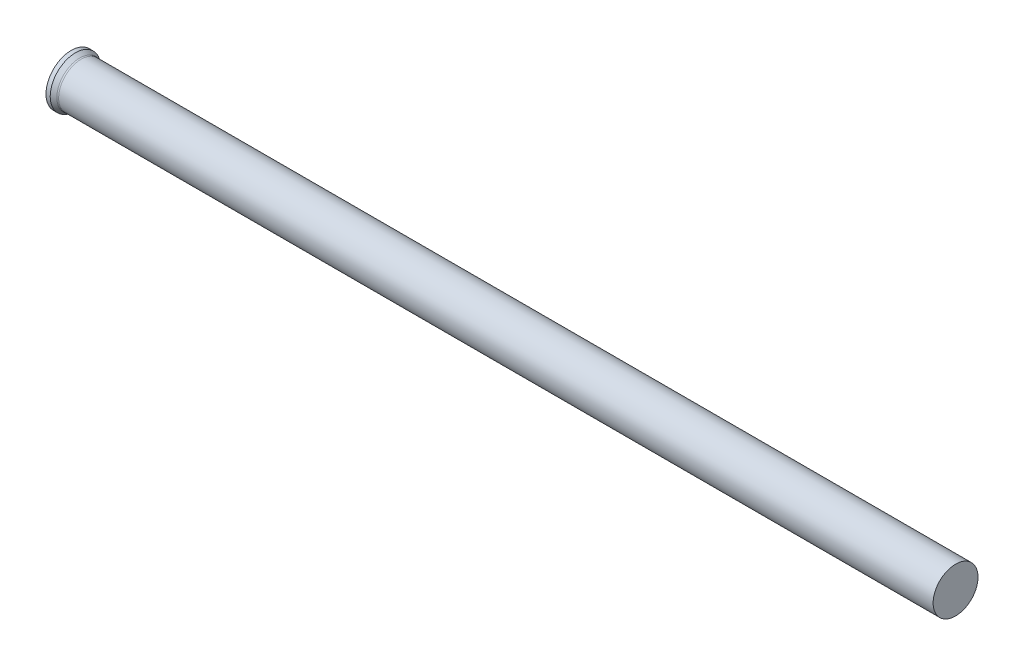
ISO-10303-21;
HEADER;
FILE_DESCRIPTION(('STEP AP214'),'2;1');
FILE_NAME('part.step','',(''),(''),'','','');
FILE_SCHEMA(('AUTOMOTIVE_DESIGN { 1 0 10303 214 1 1 1 1 }'));
ENDSEC;
DATA;
#1=APPLICATION_CONTEXT('core data for automotive mechanical design processes');
#2=APPLICATION_PROTOCOL_DEFINITION('international standard','automotive_design',2000,#1);
#3=PRODUCT_CONTEXT('',#1,'mechanical');
#4=PRODUCT('Part','Part','',(#3));
#5=PRODUCT_RELATED_PRODUCT_CATEGORY('part','',(#4));
#6=PRODUCT_DEFINITION_FORMATION('','',#4);
#7=PRODUCT_DEFINITION_CONTEXT('part definition',#1,'design');
#8=PRODUCT_DEFINITION('design','',#6,#7);
#9=PRODUCT_DEFINITION_SHAPE('','',#8);
#10=(LENGTH_UNIT() NAMED_UNIT(*) SI_UNIT(.MILLI.,.METRE.));
#11=(NAMED_UNIT(*) PLANE_ANGLE_UNIT() SI_UNIT($,.RADIAN.));
#12=(NAMED_UNIT(*) SI_UNIT($,.STERADIAN.) SOLID_ANGLE_UNIT());
#13=UNCERTAINTY_MEASURE_WITH_UNIT(LENGTH_MEASURE(1.E-05),#10,'distance_accuracy_value','');
#14=(GEOMETRIC_REPRESENTATION_CONTEXT(3) GLOBAL_UNCERTAINTY_ASSIGNED_CONTEXT((#13)) GLOBAL_UNIT_ASSIGNED_CONTEXT((#10,
#11,#12)) REPRESENTATION_CONTEXT('',''));
#15=CARTESIAN_POINT('',(0.,0.,0.));
#16=DIRECTION('',(0.,0.,1.));
#17=DIRECTION('',(1.,0.,0.));
#18=AXIS2_PLACEMENT_3D('',#15,#16,#17);
#19=CARTESIAN_POINT('',(0.,0.,0.));
#20=DIRECTION('',(1.,0.,0.));
#21=DIRECTION('',(0.,0.,-1.));
#22=AXIS2_PLACEMENT_3D('',#19,#20,#21);
#23=PLANE('',#22);
#24=CARTESIAN_POINT('',(0.,0.,0.));
#25=DIRECTION('',(-1.,0.,0.));
#26=DIRECTION('',(0.,0.,1.));
#27=AXIS2_PLACEMENT_3D('',#24,#25,#26);
#28=CIRCLE('',#27,9.);
#29=CARTESIAN_POINT('',(0.,0.,9.));
#30=VERTEX_POINT('',#29);
#31=EDGE_CURVE('E25',#30,#30,#28,.T.);
#32=ORIENTED_EDGE('',*,*,#31,.T.);
#33=EDGE_LOOP('',(#32));
#34=FACE_BOUND('',#33,.T.);
#35=ADVANCED_FACE('F14',(#34),#23,.F.);
#36=CARTESIAN_POINT('',(0.,0.,0.));
#37=DIRECTION('',(-1.,0.,0.));
#38=DIRECTION('',(0.,0.,1.));
#39=AXIS2_PLACEMENT_3D('',#36,#37,#38);
#40=CYLINDRICAL_SURFACE('',#39,9.);
#41=ORIENTED_EDGE('',*,*,#31,.F.);
#42=EDGE_LOOP('',(#41));
#43=FACE_BOUND('',#42,.T.);
#44=CARTESIAN_POINT('',(1.4979491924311,0.,0.));
#45=DIRECTION('',(-1.,0.,0.));
#46=DIRECTION('',(0.,0.,1.));
#47=AXIS2_PLACEMENT_3D('',#44,#45,#46);
#48=CIRCLE('',#47,9.);
#49=CARTESIAN_POINT('',(1.4979491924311,0.,9.));
#50=VERTEX_POINT('',#49);
#51=EDGE_CURVE('E29',#50,#50,#48,.T.);
#52=ORIENTED_EDGE('',*,*,#51,.T.);
#53=EDGE_LOOP('',(#52));
#54=FACE_BOUND('',#53,.T.);
#55=ADVANCED_FACE('F53',(#43,#54),#40,.T.);
#56=CARTESIAN_POINT('',(3.23,0.,0.));
#57=DIRECTION('',(-1.,0.,0.));
#58=DIRECTION('',(0.,0.,1.));
#59=AXIS2_PLACEMENT_3D('',#56,#57,#58);
#60=CONICAL_SURFACE('',#59,8.,0.523598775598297);
#61=CARTESIAN_POINT('',(2.99794919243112,0.,0.));
#62=DIRECTION('',(-1.,0.,0.));
#63=DIRECTION('',(0.,0.,1.));
#64=AXIS2_PLACEMENT_3D('',#61,#62,#63);
#65=CIRCLE('',#64,8.13397459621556);
#66=CARTESIAN_POINT('',(2.99794919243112,0.,8.13397459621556));
#67=VERTEX_POINT('',#66);
#68=EDGE_CURVE('E21',#67,#67,#65,.T.);
#69=ORIENTED_EDGE('',*,*,#68,.T.);
#70=EDGE_LOOP('',(#69));
#71=FACE_BOUND('',#70,.T.);
#72=ORIENTED_EDGE('',*,*,#51,.F.);
#73=EDGE_LOOP('',(#72));
#74=FACE_BOUND('',#73,.T.);
#75=ADVANCED_FACE('F50',(#71,#74),#60,.T.);
#76=CARTESIAN_POINT('',(0.,0.,0.));
#77=DIRECTION('',(-1.,0.,0.));
#78=DIRECTION('',(0.,0.,1.));
#79=AXIS2_PLACEMENT_3D('',#76,#77,#78);
#80=CYLINDRICAL_SURFACE('',#79,8.);
#81=CARTESIAN_POINT('',(3.49794919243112,0.,0.));
#82=DIRECTION('',(-1.,0.,0.));
#83=DIRECTION('',(0.,0.,1.));
#84=AXIS2_PLACEMENT_3D('',#81,#82,#83);
#85=CIRCLE('',#84,8.);
#86=CARTESIAN_POINT('',(3.49794919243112,0.,8.));
#87=VERTEX_POINT('',#86);
#88=EDGE_CURVE('E9',#87,#87,#85,.F.);
#89=ORIENTED_EDGE('',*,*,#88,.T.);
#90=EDGE_LOOP('',(#89));
#91=FACE_BOUND('',#90,.T.);
#92=CARTESIAN_POINT('',(315.,0.,0.));
#93=DIRECTION('',(-1.,0.,0.));
#94=DIRECTION('',(0.,0.,1.));
#95=AXIS2_PLACEMENT_3D('',#92,#93,#94);
#96=CIRCLE('',#95,8.);
#97=CARTESIAN_POINT('',(315.,0.,8.));
#98=VERTEX_POINT('',#97);
#99=EDGE_CURVE('E34',#98,#98,#96,.T.);
#100=ORIENTED_EDGE('',*,*,#99,.T.);
#101=EDGE_LOOP('',(#100));
#102=FACE_BOUND('',#101,.T.);
#103=ADVANCED_FACE('F38',(#91,#102),#80,.T.);
#104=CARTESIAN_POINT('',(315.,8.,0.));
#105=DIRECTION('',(-1.,0.,0.));
#106=DIRECTION('',(0.,0.,1.));
#107=AXIS2_PLACEMENT_3D('',#104,#105,#106);
#108=PLANE('',#107);
#109=ORIENTED_EDGE('',*,*,#99,.F.);
#110=EDGE_LOOP('',(#109));
#111=FACE_BOUND('',#110,.T.);
#112=ADVANCED_FACE('F40',(#111),#108,.F.);
#113=CARTESIAN_POINT('',(3.49794919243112,0.,0.));
#114=DIRECTION('',(-1.,0.,0.));
#115=DIRECTION('',(0.,0.,1.));
#116=AXIS2_PLACEMENT_3D('',#113,#114,#115);
#117=TOROIDAL_SURFACE('',#116,9.,1.);
#118=ORIENTED_EDGE('',*,*,#88,.F.);
#119=EDGE_LOOP('',(#118));
#120=FACE_BOUND('',#119,.T.);
#121=ORIENTED_EDGE('',*,*,#68,.F.);
#122=EDGE_LOOP('',(#121));
#123=FACE_BOUND('',#122,.T.);
#124=ADVANCED_FACE('F16',(#120,#123),#117,.F.);
#125=CLOSED_SHELL('',(#35,#55,#75,#103,#112,#124));
#126=MANIFOLD_SOLID_BREP('B1',#125);
#127=ADVANCED_BREP_SHAPE_REPRESENTATION('',(#18,#126),#14);
#128=SHAPE_DEFINITION_REPRESENTATION(#9,#127);
ENDSEC;
END-ISO-10303-21;
